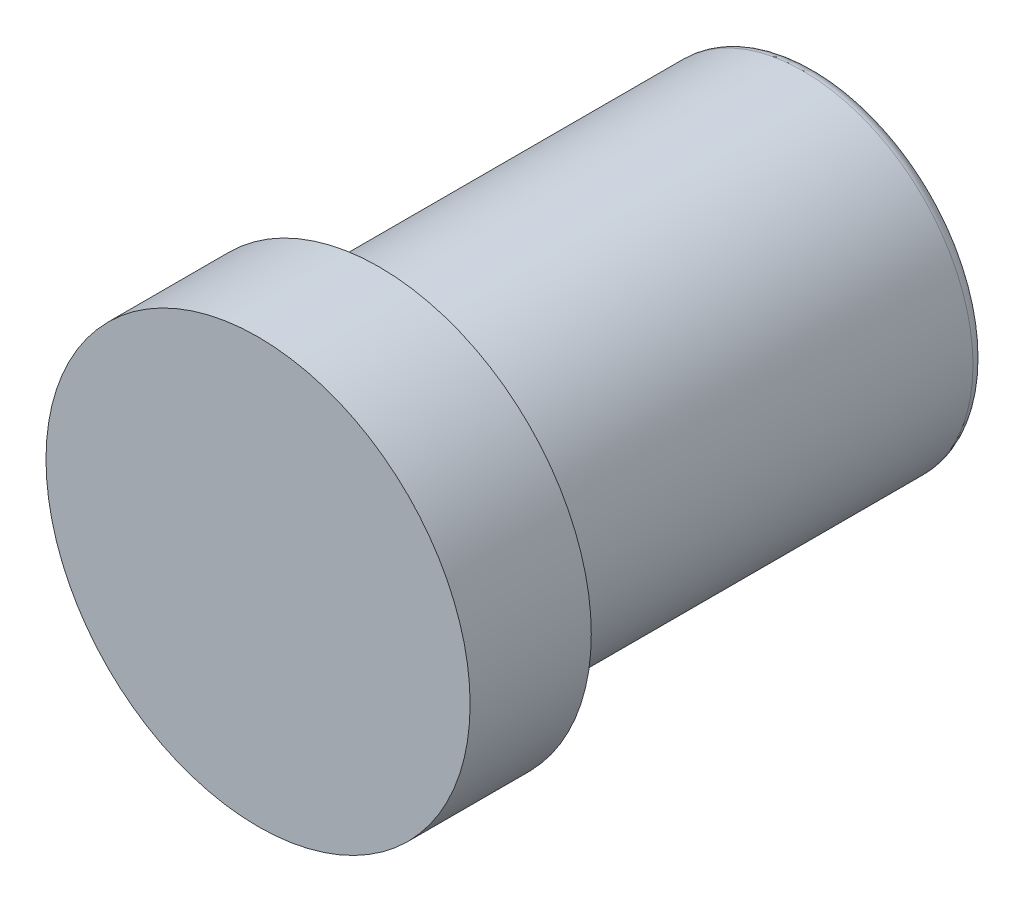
ISO-10303-21;
HEADER;
FILE_DESCRIPTION(('STEP AP214'),'2;1');
FILE_NAME('part.step','',(''),(''),'','','');
FILE_SCHEMA(('AUTOMOTIVE_DESIGN { 1 0 10303 214 1 1 1 1 }'));
ENDSEC;
DATA;
#1=APPLICATION_CONTEXT('core data for automotive mechanical design processes');
#2=APPLICATION_PROTOCOL_DEFINITION('international standard','automotive_design',2000,#1);
#3=PRODUCT_CONTEXT('',#1,'mechanical');
#4=PRODUCT('Part','Part','',(#3));
#5=PRODUCT_RELATED_PRODUCT_CATEGORY('part','',(#4));
#6=PRODUCT_DEFINITION_FORMATION('','',#4);
#7=PRODUCT_DEFINITION_CONTEXT('part definition',#1,'design');
#8=PRODUCT_DEFINITION('design','',#6,#7);
#9=PRODUCT_DEFINITION_SHAPE('','',#8);
#10=(LENGTH_UNIT() NAMED_UNIT(*) SI_UNIT(.MILLI.,.METRE.));
#11=(NAMED_UNIT(*) PLANE_ANGLE_UNIT() SI_UNIT($,.RADIAN.));
#12=(NAMED_UNIT(*) SI_UNIT($,.STERADIAN.) SOLID_ANGLE_UNIT());
#13=UNCERTAINTY_MEASURE_WITH_UNIT(LENGTH_MEASURE(1.E-05),#10,'distance_accuracy_value','');
#14=(GEOMETRIC_REPRESENTATION_CONTEXT(3) GLOBAL_UNCERTAINTY_ASSIGNED_CONTEXT((#13)) GLOBAL_UNIT_ASSIGNED_CONTEXT((#10,
#11,#12)) REPRESENTATION_CONTEXT('',''));
#15=CARTESIAN_POINT('',(0.,0.,0.));
#16=DIRECTION('',(0.,0.,1.));
#17=DIRECTION('',(1.,0.,0.));
#18=AXIS2_PLACEMENT_3D('',#15,#16,#17);
#19=CARTESIAN_POINT('',(0.,0.,-46.));
#20=DIRECTION('',(0.,0.,1.));
#21=DIRECTION('',(1.,0.,0.));
#22=AXIS2_PLACEMENT_3D('',#19,#20,#21);
#23=PLANE('',#22);
#24=CARTESIAN_POINT('',(0.,0.,-46.));
#25=DIRECTION('',(0.,0.,-1.));
#26=DIRECTION('',(-1.,0.,0.));
#27=AXIS2_PLACEMENT_3D('',#24,#25,#26);
#28=CIRCLE('',#27,3.025);
#29=CARTESIAN_POINT('',(-3.025,0.,-46.));
#30=VERTEX_POINT('',#29);
#31=EDGE_CURVE('E62',#30,#30,#28,.T.);
#32=ORIENTED_EDGE('',*,*,#31,.F.);
#33=EDGE_LOOP('',(#32));
#34=FACE_BOUND('',#33,.T.);
#35=CARTESIAN_POINT('',(0.,0.,-46.));
#36=DIRECTION('',(0.,0.,1.));
#37=DIRECTION('',(1.,0.,0.));
#38=AXIS2_PLACEMENT_3D('',#35,#36,#37);
#39=CIRCLE('',#38,13.);
#40=CARTESIAN_POINT('',(13.,0.,-46.));
#41=VERTEX_POINT('',#40);
#42=EDGE_CURVE('E11',#41,#41,#39,.T.);
#43=ORIENTED_EDGE('',*,*,#42,.F.);
#44=EDGE_LOOP('',(#43));
#45=FACE_BOUND('',#44,.T.);
#46=ADVANCED_FACE('F36',(#34,#45),#23,.F.);
#47=CARTESIAN_POINT('',(0.,0.,-45.));
#48=DIRECTION('',(0.,0.,1.));
#49=DIRECTION('',(1.,0.,0.));
#50=AXIS2_PLACEMENT_3D('',#47,#48,#49);
#51=TOROIDAL_SURFACE('',#50,13.,1.);
#52=CARTESIAN_POINT('',(0.,0.,-45.));
#53=DIRECTION('',(0.,0.,1.));
#54=DIRECTION('',(1.,0.,0.));
#55=AXIS2_PLACEMENT_3D('',#52,#53,#54);
#56=CIRCLE('',#55,14.);
#57=CARTESIAN_POINT('',(14.,0.,-45.));
#58=VERTEX_POINT('',#57);
#59=EDGE_CURVE('E42',#58,#58,#56,.T.);
#60=ORIENTED_EDGE('',*,*,#59,.F.);
#61=EDGE_LOOP('',(#60));
#62=FACE_BOUND('',#61,.T.);
#63=ORIENTED_EDGE('',*,*,#42,.T.);
#64=EDGE_LOOP('',(#63));
#65=FACE_BOUND('',#64,.T.);
#66=ADVANCED_FACE('F75',(#62,#65),#51,.T.);
#67=CARTESIAN_POINT('',(0.,0.,0.));
#68=DIRECTION('',(0.,0.,1.));
#69=DIRECTION('',(1.,0.,0.));
#70=AXIS2_PLACEMENT_3D('',#67,#68,#69);
#71=CYLINDRICAL_SURFACE('',#70,14.);
#72=CARTESIAN_POINT('',(0.,0.,-10.));
#73=DIRECTION('',(0.,0.,1.));
#74=DIRECTION('',(1.,0.,0.));
#75=AXIS2_PLACEMENT_3D('',#72,#73,#74);
#76=CIRCLE('',#75,14.);
#77=CARTESIAN_POINT('',(14.,0.,-10.));
#78=VERTEX_POINT('',#77);
#79=EDGE_CURVE('E68',#78,#78,#76,.T.);
#80=ORIENTED_EDGE('',*,*,#79,.F.);
#81=EDGE_LOOP('',(#80));
#82=FACE_BOUND('',#81,.T.);
#83=ORIENTED_EDGE('',*,*,#59,.T.);
#84=EDGE_LOOP('',(#83));
#85=FACE_BOUND('',#84,.T.);
#86=ADVANCED_FACE('F73',(#82,#85),#71,.T.);
#87=CARTESIAN_POINT('',(0.,14.,-10.));
#88=DIRECTION('',(0.,0.,1.));
#89=DIRECTION('',(1.,0.,0.));
#90=AXIS2_PLACEMENT_3D('',#87,#88,#89);
#91=PLANE('',#90);
#92=CARTESIAN_POINT('',(0.,0.,-10.));
#93=DIRECTION('',(0.,0.,1.));
#94=DIRECTION('',(1.,0.,0.));
#95=AXIS2_PLACEMENT_3D('',#92,#93,#94);
#96=CIRCLE('',#95,17.5);
#97=CARTESIAN_POINT('',(17.5,0.,-10.));
#98=VERTEX_POINT('',#97);
#99=EDGE_CURVE('E59',#98,#98,#96,.T.);
#100=ORIENTED_EDGE('',*,*,#99,.F.);
#101=EDGE_LOOP('',(#100));
#102=FACE_BOUND('',#101,.T.);
#103=ORIENTED_EDGE('',*,*,#79,.T.);
#104=EDGE_LOOP('',(#103));
#105=FACE_BOUND('',#104,.T.);
#106=ADVANCED_FACE('F103',(#102,#105),#91,.F.);
#107=CARTESIAN_POINT('',(0.,0.,0.));
#108=DIRECTION('',(0.,0.,1.));
#109=DIRECTION('',(1.,0.,0.));
#110=AXIS2_PLACEMENT_3D('',#107,#108,#109);
#111=CYLINDRICAL_SURFACE('',#110,17.5);
#112=CARTESIAN_POINT('',(0.,0.,0.));
#113=DIRECTION('',(0.,0.,1.));
#114=DIRECTION('',(1.,0.,0.));
#115=AXIS2_PLACEMENT_3D('',#112,#113,#114);
#116=CIRCLE('',#115,17.5);
#117=CARTESIAN_POINT('',(17.5,0.,0.));
#118=VERTEX_POINT('',#117);
#119=EDGE_CURVE('E55',#118,#118,#116,.T.);
#120=ORIENTED_EDGE('',*,*,#119,.F.);
#121=EDGE_LOOP('',(#120));
#122=FACE_BOUND('',#121,.T.);
#123=ORIENTED_EDGE('',*,*,#99,.T.);
#124=EDGE_LOOP('',(#123));
#125=FACE_BOUND('',#124,.T.);
#126=ADVANCED_FACE('F99',(#122,#125),#111,.T.);
#127=CARTESIAN_POINT('',(0.,17.5,0.));
#128=DIRECTION('',(0.,0.,-1.));
#129=DIRECTION('',(-1.,0.,0.));
#130=AXIS2_PLACEMENT_3D('',#127,#128,#129);
#131=PLANE('',#130);
#132=ORIENTED_EDGE('',*,*,#119,.T.);
#133=EDGE_LOOP('',(#132));
#134=FACE_BOUND('',#133,.T.);
#135=ADVANCED_FACE('F49',(#134),#131,.F.);
#136=CARTESIAN_POINT('',(0.,0.,-38.));
#137=DIRECTION('',(0.,0.,-1.));
#138=DIRECTION('',(-1.,0.,0.));
#139=AXIS2_PLACEMENT_3D('',#136,#137,#138);
#140=CONICAL_SURFACE('',#139,2.5,1.02974425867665);
#141=CARTESIAN_POINT('',(0.,0.,-36.4978484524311));
#142=VERTEX_POINT('',#141);
#143=VERTEX_LOOP('',#142);
#144=FACE_BOUND('',#143,.T.);
#145=CARTESIAN_POINT('',(0.,0.,-38.));
#146=DIRECTION('',(0.,0.,-1.));
#147=DIRECTION('',(-1.,0.,0.));
#148=AXIS2_PLACEMENT_3D('',#145,#146,#147);
#149=CIRCLE('',#148,2.5);
#150=CARTESIAN_POINT('',(-2.5,0.,-38.));
#151=VERTEX_POINT('',#150);
#152=EDGE_CURVE('E53',#151,#151,#149,.T.);
#153=ORIENTED_EDGE('',*,*,#152,.T.);
#154=EDGE_LOOP('',(#153));
#155=FACE_BOUND('',#154,.T.);
#156=ADVANCED_FACE('F45',(#144,#155),#140,.F.);
#157=CARTESIAN_POINT('',(0.,0.,-46.));
#158=DIRECTION('',(0.,0.,-1.));
#159=DIRECTION('',(-1.,0.,0.));
#160=AXIS2_PLACEMENT_3D('',#157,#158,#159);
#161=CYLINDRICAL_SURFACE('',#160,2.5);
#162=ORIENTED_EDGE('',*,*,#152,.F.);
#163=EDGE_LOOP('',(#162));
#164=FACE_BOUND('',#163,.T.);
#165=CARTESIAN_POINT('',(0.,0.,-45.475));
#166=DIRECTION('',(0.,0.,-1.));
#167=DIRECTION('',(-1.,0.,0.));
#168=AXIS2_PLACEMENT_3D('',#165,#166,#167);
#169=CIRCLE('',#168,2.5);
#170=CARTESIAN_POINT('',(-2.5,0.,-45.475));
#171=VERTEX_POINT('',#170);
#172=EDGE_CURVE('E56',#171,#171,#169,.T.);
#173=ORIENTED_EDGE('',*,*,#172,.T.);
#174=EDGE_LOOP('',(#173));
#175=FACE_BOUND('',#174,.T.);
#176=ADVANCED_FACE('F48',(#164,#175),#161,.F.);
#177=CARTESIAN_POINT('',(0.,0.,-46.));
#178=DIRECTION('',(0.,0.,-1.));
#179=DIRECTION('',(-1.,0.,0.));
#180=AXIS2_PLACEMENT_3D('',#177,#178,#179);
#181=CONICAL_SURFACE('',#180,3.025,0.785398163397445);
#182=ORIENTED_EDGE('',*,*,#172,.F.);
#183=EDGE_LOOP('',(#182));
#184=FACE_BOUND('',#183,.T.);
#185=ORIENTED_EDGE('',*,*,#31,.T.);
#186=EDGE_LOOP('',(#185));
#187=FACE_BOUND('',#186,.T.);
#188=ADVANCED_FACE('F87',(#184,#187),#181,.F.);
#189=CLOSED_SHELL('',(#46,#66,#86,#106,#126,#135,#156,#176,#188));
#190=MANIFOLD_SOLID_BREP('B2',#189);
#191=ADVANCED_BREP_SHAPE_REPRESENTATION('',(#18,#190),#14);
#192=SHAPE_DEFINITION_REPRESENTATION(#9,#191);
ENDSEC;
END-ISO-10303-21;
